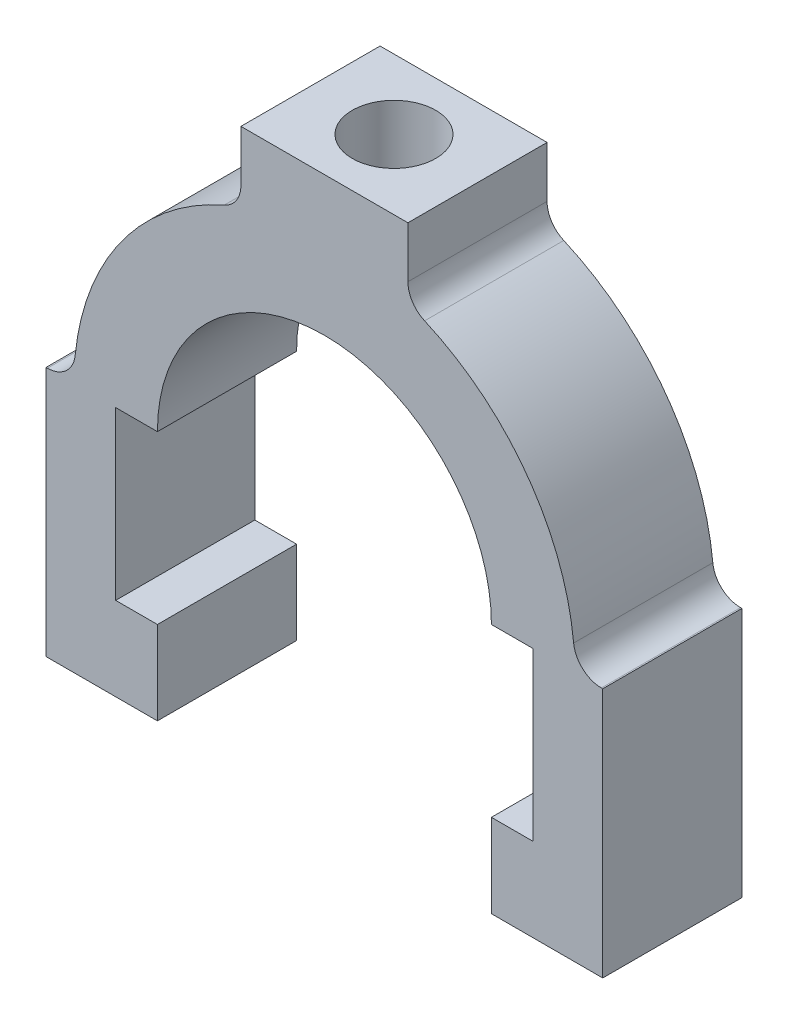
from build123d import *

# Parameters (mm, degrees)
BOSS_EXTRUDE1_DEPTH = 20
SKETCH3_R           = 6
CUT_EXTRUDE1_DEPTH  = 38


with BuildPart() as part:
    # Sketch2 → Boss-Extrude1 (new body)
    with BuildSketch(Plane.XY):
        with BuildLine():
            Line((0, 0), (12, 0))
            Line((12, 0), (12, -7.33939444))
            ThreePointArc((12, -7.33939444), (12.653359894, -9.53028467), (14.4, -11.005454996))
            ThreePointArc((14.4, -11.005454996), (29.094854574, -22.798834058), (35.819547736, -40.4))
            ThreePointArc((35.819547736, -40.4), (37.116215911, -42.966479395), (39.799497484, -44))
            Line((39.799497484, -44), (40, -44))
            Line((40, -44), (40, -80))
            Line((40, -80), (24, -80))
            Line((24, -80), (24, -68))
            Line((24, -68), (30, -68))
            Line((30, -68), (30, -44))
            Line((30, -44), (24, -44))
            ThreePointArc((24, -44), (16.970562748, -27.029437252), (0, -20))
            Line((0, -20), (0, 0))
        make_face()
    boss_extrude1 = extrude(amount=BOSS_EXTRUDE1_DEPTH)

    # Mirror1: Boss-Extrude1 across plane
    add(boss_extrude1.mirror(Plane(origin=(0, -20, 20), x_dir=(0, 0, 1), z_dir=(1, 0, 0))))

    # Sketch3 → Cut-Extrude1 (cut)
    with BuildSketch(Plane(origin=(0, 0, 0), x_dir=(1, 0, 0), z_dir=(0, 1, 0))):
        with Locations(Location((0, -10, 0), (0, 0, 270))):
            Circle(SKETCH3_R)
    extrude(amount=-CUT_EXTRUDE1_DEPTH, mode=Mode.SUBTRACT)


solid = part.part
